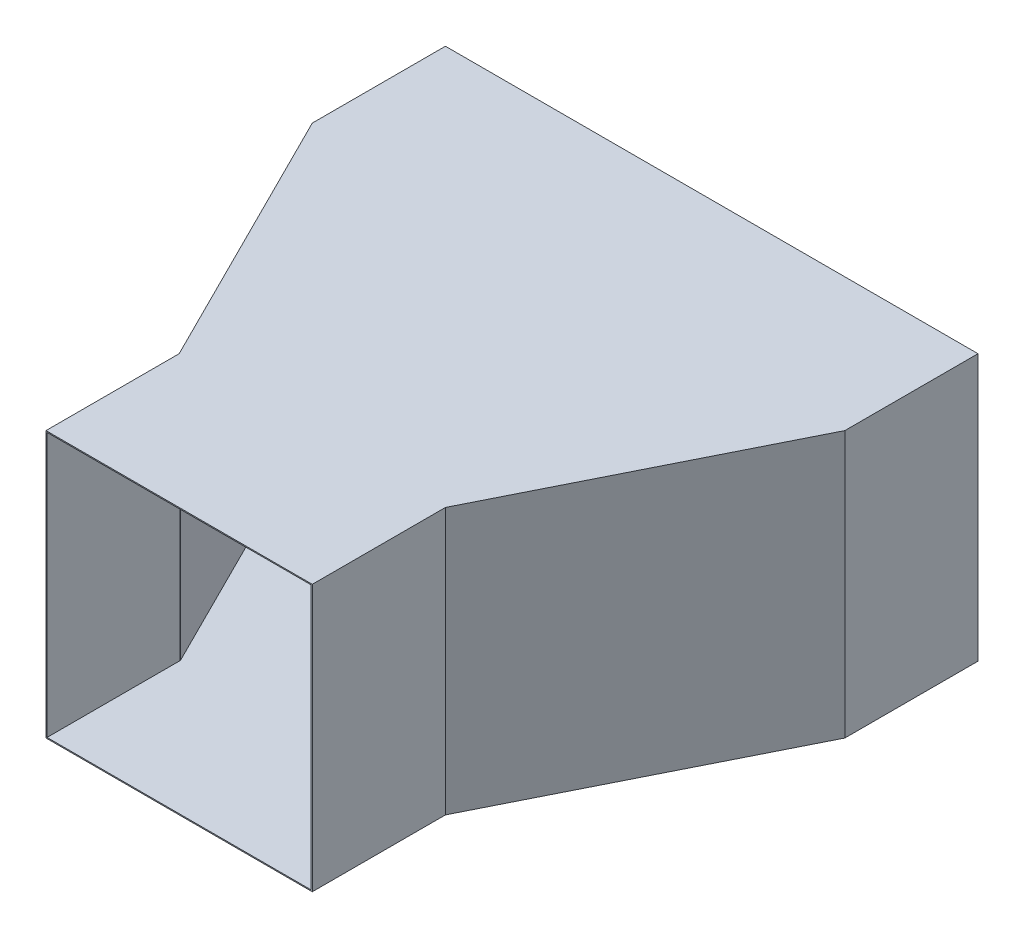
ISO-10303-21;
HEADER;
FILE_DESCRIPTION(('STEP AP214'),'2;1');
FILE_NAME('part.step','',(''),(''),'','','');
FILE_SCHEMA(('AUTOMOTIVE_DESIGN { 1 0 10303 214 1 1 1 1 }'));
ENDSEC;
DATA;
#1=APPLICATION_CONTEXT('core data for automotive mechanical design processes');
#2=APPLICATION_PROTOCOL_DEFINITION('international standard','automotive_design',2000,#1);
#3=PRODUCT_CONTEXT('',#1,'mechanical');
#4=PRODUCT('Part','Part','',(#3));
#5=PRODUCT_RELATED_PRODUCT_CATEGORY('part','',(#4));
#6=PRODUCT_DEFINITION_FORMATION('','',#4);
#7=PRODUCT_DEFINITION_CONTEXT('part definition',#1,'design');
#8=PRODUCT_DEFINITION('design','',#6,#7);
#9=PRODUCT_DEFINITION_SHAPE('','',#8);
#10=(LENGTH_UNIT() NAMED_UNIT(*) SI_UNIT(.MILLI.,.METRE.));
#11=(NAMED_UNIT(*) PLANE_ANGLE_UNIT() SI_UNIT($,.RADIAN.));
#12=(NAMED_UNIT(*) SI_UNIT($,.STERADIAN.) SOLID_ANGLE_UNIT());
#13=UNCERTAINTY_MEASURE_WITH_UNIT(LENGTH_MEASURE(1.E-05),#10,'distance_accuracy_value','');
#14=(GEOMETRIC_REPRESENTATION_CONTEXT(3) GLOBAL_UNCERTAINTY_ASSIGNED_CONTEXT((#13)) GLOBAL_UNIT_ASSIGNED_CONTEXT((#10,
#11,#12)) REPRESENTATION_CONTEXT('',''));
#15=CARTESIAN_POINT('',(0.,0.,0.));
#16=DIRECTION('',(0.,0.,1.));
#17=DIRECTION('',(1.,0.,0.));
#18=AXIS2_PLACEMENT_3D('',#15,#16,#17);
#19=CARTESIAN_POINT('',(0.,0.,500.));
#20=DIRECTION('',(0.,0.,1.));
#21=DIRECTION('',(1.,0.,0.));
#22=AXIS2_PLACEMENT_3D('',#19,#20,#21);
#23=PLANE('',#22);
#24=DIRECTION('',(0.,-1.,0.));
#25=VECTOR('',#24,1.);
#26=CARTESIAN_POINT('',(-247.7639320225,0.,500.));
#27=LINE('',#26,#25);
#28=CARTESIAN_POINT('',(-247.7639320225,248.,500.));
#29=VERTEX_POINT('',#28);
#30=CARTESIAN_POINT('',(-247.7639320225,-248.,500.));
#31=VERTEX_POINT('',#30);
#32=EDGE_CURVE('E367',#29,#31,#27,.T.);
#33=ORIENTED_EDGE('',*,*,#32,.F.);
#34=DIRECTION('',(-1.,0.,0.));
#35=VECTOR('',#34,1.);
#36=CARTESIAN_POINT('',(-250.,248.,500.));
#37=LINE('',#36,#35);
#38=CARTESIAN_POINT('',(-248.,248.,500.));
#39=VERTEX_POINT('',#38);
#40=EDGE_CURVE('E12',#29,#39,#37,.T.);
#41=ORIENTED_EDGE('',*,*,#40,.T.);
#42=DIRECTION('',(0.,-1.,0.));
#43=VECTOR('',#42,1.);
#44=CARTESIAN_POINT('',(-248.,250.,500.));
#45=LINE('',#44,#43);
#46=CARTESIAN_POINT('',(-248.,-248.,500.));
#47=VERTEX_POINT('',#46);
#48=EDGE_CURVE('E263',#39,#47,#45,.T.);
#49=ORIENTED_EDGE('',*,*,#48,.T.);
#50=DIRECTION('',(1.,0.,0.));
#51=VECTOR('',#50,1.);
#52=CARTESIAN_POINT('',(-250.,-248.,500.));
#53=LINE('',#52,#51);
#54=EDGE_CURVE('E241',#47,#31,#53,.T.);
#55=ORIENTED_EDGE('',*,*,#54,.T.);
#56=EDGE_LOOP('',(#33,#41,#49,#55));
#57=FACE_BOUND('',#56,.T.);
#58=ADVANCED_FACE('F90',(#57),#23,.T.);
#59=DIRECTION('',(0.,1.,0.));
#60=VECTOR('',#59,1.);
#61=CARTESIAN_POINT('',(248.,250.,500.));
#62=LINE('',#61,#60);
#63=CARTESIAN_POINT('',(248.,-248.,500.));
#64=VERTEX_POINT('',#63);
#65=CARTESIAN_POINT('',(248.,248.,500.));
#66=VERTEX_POINT('',#65);
#67=EDGE_CURVE('E261',#64,#66,#62,.T.);
#68=ORIENTED_EDGE('',*,*,#67,.T.);
#69=CARTESIAN_POINT('',(247.7639320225,248.,500.));
#70=VERTEX_POINT('',#69);
#71=EDGE_CURVE('E248',#66,#70,#37,.T.);
#72=ORIENTED_EDGE('',*,*,#71,.T.);
#73=DIRECTION('',(0.,1.,0.));
#74=VECTOR('',#73,1.);
#75=CARTESIAN_POINT('',(247.7639320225,0.,500.));
#76=LINE('',#75,#74);
#77=CARTESIAN_POINT('',(247.7639320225,-248.,500.));
#78=VERTEX_POINT('',#77);
#79=EDGE_CURVE('E373',#78,#70,#76,.T.);
#80=ORIENTED_EDGE('',*,*,#79,.F.);
#81=EDGE_CURVE('E101',#78,#64,#53,.T.);
#82=ORIENTED_EDGE('',*,*,#81,.T.);
#83=EDGE_LOOP('',(#68,#72,#80,#82));
#84=FACE_BOUND('',#83,.T.);
#85=ADVANCED_FACE('F520',(#84),#23,.T.);
#86=CARTESIAN_POINT('',(500.,250.,-250.));
#87=DIRECTION('',(1.,0.,0.));
#88=DIRECTION('',(0.,0.,-1.));
#89=AXIS2_PLACEMENT_3D('',#86,#87,#88);
#90=PLANE('',#89);
#91=CARTESIAN_POINT('',(500.,-250.,0.));
#92=DIRECTION('',(0.,1.,0.));
#93=VECTOR('',#92,1.);
#94=LINE('',#91,#93);
#95=CARTESIAN_POINT('',(500.,-250.,0.));
#96=VERTEX_POINT('',#95);
#97=CARTESIAN_POINT('',(500.,250.,0.));
#98=VERTEX_POINT('',#97);
#99=EDGE_CURVE('E462',#96,#98,#94,.T.);
#100=ORIENTED_EDGE('',*,*,#99,.F.);
#101=DIRECTION('',(0.,0.,1.));
#102=VECTOR('',#101,1.);
#103=CARTESIAN_POINT('',(500.,-250.,-250.));
#104=LINE('',#103,#102);
#105=CARTESIAN_POINT('',(500.,-250.,-250.));
#106=VERTEX_POINT('',#105);
#107=EDGE_CURVE('E491',#106,#96,#104,.T.);
#108=ORIENTED_EDGE('',*,*,#107,.F.);
#109=DIRECTION('',(0.,1.,0.));
#110=VECTOR('',#109,1.);
#111=CARTESIAN_POINT('',(500.,250.,-250.));
#112=LINE('',#111,#110);
#113=CARTESIAN_POINT('',(500.,250.,-250.));
#114=VERTEX_POINT('',#113);
#115=EDGE_CURVE('E470',#106,#114,#112,.T.);
#116=ORIENTED_EDGE('',*,*,#115,.T.);
#117=DIRECTION('',(0.,0.,1.));
#118=VECTOR('',#117,1.);
#119=CARTESIAN_POINT('',(500.,250.,-250.));
#120=LINE('',#119,#118);
#121=EDGE_CURVE('E479',#114,#98,#120,.T.);
#122=ORIENTED_EDGE('',*,*,#121,.T.);
#123=EDGE_LOOP('',(#100,#108,#116,#122));
#124=FACE_BOUND('',#123,.T.);
#125=ADVANCED_FACE('F92',(#124),#90,.T.);
#126=CARTESIAN_POINT('',(-500.,-250.,-250.));
#127=DIRECTION('',(0.,-1.,0.));
#128=DIRECTION('',(0.,0.,-1.));
#129=AXIS2_PLACEMENT_3D('',#126,#127,#128);
#130=PLANE('',#129);
#131=ORIENTED_EDGE('',*,*,#107,.T.);
#132=DIRECTION('',(0.447213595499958,0.,-0.894427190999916));
#133=VECTOR('',#132,1.);
#134=CARTESIAN_POINT('',(250.,-250.,500.));
#135=LINE('',#134,#133);
#136=CARTESIAN_POINT('',(250.,-250.,500.));
#137=VERTEX_POINT('',#136);
#138=EDGE_CURVE('E370',#137,#96,#135,.T.);
#139=ORIENTED_EDGE('',*,*,#138,.F.);
#140=DIRECTION('',(0.,0.,-1.));
#141=VECTOR('',#140,1.);
#142=CARTESIAN_POINT('',(250.,-250.,750.));
#143=LINE('',#142,#141);
#144=CARTESIAN_POINT('',(250.,-250.,750.));
#145=VERTEX_POINT('',#144);
#146=EDGE_CURVE('E278',#145,#137,#143,.T.);
#147=ORIENTED_EDGE('',*,*,#146,.F.);
#148=DIRECTION('',(1.,0.,0.));
#149=VECTOR('',#148,1.);
#150=CARTESIAN_POINT('',(-250.,-250.,750.));
#151=LINE('',#150,#149);
#152=CARTESIAN_POINT('',(-250.,-250.,750.));
#153=VERTEX_POINT('',#152);
#154=EDGE_CURVE('E276',#153,#145,#151,.T.);
#155=ORIENTED_EDGE('',*,*,#154,.F.);
#156=DIRECTION('',(0.,0.,-1.));
#157=VECTOR('',#156,1.);
#158=CARTESIAN_POINT('',(-250.,-250.,750.));
#159=LINE('',#158,#157);
#160=CARTESIAN_POINT('',(-250.,-250.,500.));
#161=VERTEX_POINT('',#160);
#162=EDGE_CURVE('E297',#153,#161,#159,.T.);
#163=ORIENTED_EDGE('',*,*,#162,.T.);
#164=DIRECTION('',(-0.447213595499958,0.,-0.894427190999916));
#165=VECTOR('',#164,1.);
#166=CARTESIAN_POINT('',(-250.,-250.,500.));
#167=LINE('',#166,#165);
#168=CARTESIAN_POINT('',(-500.,-250.,0.));
#169=VERTEX_POINT('',#168);
#170=EDGE_CURVE('E366',#161,#169,#167,.T.);
#171=ORIENTED_EDGE('',*,*,#170,.T.);
#172=DIRECTION('',(0.,0.,1.));
#173=VECTOR('',#172,1.);
#174=CARTESIAN_POINT('',(-500.,-250.,-250.));
#175=LINE('',#174,#173);
#176=CARTESIAN_POINT('',(-500.,-250.,-250.));
#177=VERTEX_POINT('',#176);
#178=EDGE_CURVE('E485',#177,#169,#175,.T.);
#179=ORIENTED_EDGE('',*,*,#178,.F.);
#180=DIRECTION('',(1.,0.,0.));
#181=VECTOR('',#180,1.);
#182=CARTESIAN_POINT('',(-500.,-250.,-250.));
#183=LINE('',#182,#181);
#184=EDGE_CURVE('E477',#177,#106,#183,.T.);
#185=ORIENTED_EDGE('',*,*,#184,.T.);
#186=EDGE_LOOP('',(#131,#139,#147,#155,#163,#171,#179,#185));
#187=FACE_BOUND('',#186,.T.);
#188=ADVANCED_FACE('F494',(#187),#130,.T.);
#189=CARTESIAN_POINT('',(-500.,250.,-250.));
#190=DIRECTION('',(-1.,0.,0.));
#191=DIRECTION('',(0.,-1.,0.));
#192=AXIS2_PLACEMENT_3D('',#189,#190,#191);
#193=PLANE('',#192);
#194=CARTESIAN_POINT('',(-500.,250.,0.));
#195=DIRECTION('',(0.,-1.,0.));
#196=VECTOR('',#195,1.);
#197=LINE('',#194,#196);
#198=CARTESIAN_POINT('',(-500.,250.,0.));
#199=VERTEX_POINT('',#198);
#200=EDGE_CURVE('E415',#199,#169,#197,.T.);
#201=ORIENTED_EDGE('',*,*,#200,.F.);
#202=DIRECTION('',(0.,0.,1.));
#203=VECTOR('',#202,1.);
#204=CARTESIAN_POINT('',(-500.,250.,-250.));
#205=LINE('',#204,#203);
#206=CARTESIAN_POINT('',(-500.,250.,-250.));
#207=VERTEX_POINT('',#206);
#208=EDGE_CURVE('E362',#207,#199,#205,.T.);
#209=ORIENTED_EDGE('',*,*,#208,.F.);
#210=DIRECTION('',(0.,-1.,0.));
#211=VECTOR('',#210,1.);
#212=CARTESIAN_POINT('',(-500.,250.,-250.));
#213=LINE('',#212,#211);
#214=EDGE_CURVE('E475',#207,#177,#213,.T.);
#215=ORIENTED_EDGE('',*,*,#214,.T.);
#216=ORIENTED_EDGE('',*,*,#178,.T.);
#217=EDGE_LOOP('',(#201,#209,#215,#216));
#218=FACE_BOUND('',#217,.T.);
#219=ADVANCED_FACE('F570',(#218),#193,.T.);
#220=CARTESIAN_POINT('',(-500.,250.,-250.));
#221=DIRECTION('',(0.,1.,0.));
#222=DIRECTION('',(0.,0.,1.));
#223=AXIS2_PLACEMENT_3D('',#220,#221,#222);
#224=PLANE('',#223);
#225=ORIENTED_EDGE('',*,*,#208,.T.);
#226=DIRECTION('',(-0.447213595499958,0.,-0.894427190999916));
#227=VECTOR('',#226,1.);
#228=CARTESIAN_POINT('',(-250.,250.,500.));
#229=LINE('',#228,#227);
#230=CARTESIAN_POINT('',(-250.,250.,500.));
#231=VERTEX_POINT('',#230);
#232=EDGE_CURVE('E360',#231,#199,#229,.T.);
#233=ORIENTED_EDGE('',*,*,#232,.F.);
#234=DIRECTION('',(0.,0.,-1.));
#235=VECTOR('',#234,1.);
#236=CARTESIAN_POINT('',(-250.,250.,750.));
#237=LINE('',#236,#235);
#238=CARTESIAN_POINT('',(-250.,250.,750.));
#239=VERTEX_POINT('',#238);
#240=EDGE_CURVE('E302',#239,#231,#237,.T.);
#241=ORIENTED_EDGE('',*,*,#240,.F.);
#242=DIRECTION('',(-1.,0.,0.));
#243=VECTOR('',#242,1.);
#244=CARTESIAN_POINT('',(-250.,250.,750.));
#245=LINE('',#244,#243);
#246=CARTESIAN_POINT('',(250.,250.,750.));
#247=VERTEX_POINT('',#246);
#248=EDGE_CURVE('E272',#247,#239,#245,.T.);
#249=ORIENTED_EDGE('',*,*,#248,.F.);
#250=DIRECTION('',(0.,0.,-1.));
#251=VECTOR('',#250,1.);
#252=CARTESIAN_POINT('',(250.,250.,750.));
#253=LINE('',#252,#251);
#254=CARTESIAN_POINT('',(250.,250.,500.));
#255=VERTEX_POINT('',#254);
#256=EDGE_CURVE('E349',#247,#255,#253,.T.);
#257=ORIENTED_EDGE('',*,*,#256,.T.);
#258=DIRECTION('',(0.447213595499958,0.,-0.894427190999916));
#259=VECTOR('',#258,1.);
#260=CARTESIAN_POINT('',(250.,250.,500.));
#261=LINE('',#260,#259);
#262=EDGE_CURVE('E497',#255,#98,#261,.T.);
#263=ORIENTED_EDGE('',*,*,#262,.T.);
#264=ORIENTED_EDGE('',*,*,#121,.F.);
#265=DIRECTION('',(-1.,0.,0.));
#266=VECTOR('',#265,1.);
#267=CARTESIAN_POINT('',(-500.,250.,-250.));
#268=LINE('',#267,#266);
#269=EDGE_CURVE('E473',#114,#207,#268,.T.);
#270=ORIENTED_EDGE('',*,*,#269,.T.);
#271=EDGE_LOOP('',(#225,#233,#241,#249,#257,#263,#264,#270));
#272=FACE_BOUND('',#271,.T.);
#273=ADVANCED_FACE('F358',(#272),#224,.T.);
#274=CARTESIAN_POINT('',(0.,0.,-250.));
#275=DIRECTION('',(0.,0.,1.));
#276=DIRECTION('',(1.,0.,0.));
#277=AXIS2_PLACEMENT_3D('',#274,#275,#276);
#278=PLANE('',#277);
#279=DIRECTION('',(1.,0.,0.));
#280=VECTOR('',#279,1.);
#281=CARTESIAN_POINT('',(-500.,-248.,-250.));
#282=LINE('',#281,#280);
#283=CARTESIAN_POINT('',(-498.,-248.,-250.));
#284=VERTEX_POINT('',#283);
#285=CARTESIAN_POINT('',(498.,-248.,-250.));
#286=VERTEX_POINT('',#285);
#287=EDGE_CURVE('E434',#284,#286,#282,.T.);
#288=ORIENTED_EDGE('',*,*,#287,.T.);
#289=DIRECTION('',(0.,1.,0.));
#290=VECTOR('',#289,1.);
#291=CARTESIAN_POINT('',(498.,250.,-250.));
#292=LINE('',#291,#290);
#293=CARTESIAN_POINT('',(498.,248.,-250.));
#294=VERTEX_POINT('',#293);
#295=EDGE_CURVE('E426',#286,#294,#292,.T.);
#296=ORIENTED_EDGE('',*,*,#295,.T.);
#297=DIRECTION('',(-1.,0.,0.));
#298=VECTOR('',#297,1.);
#299=CARTESIAN_POINT('',(-500.,248.,-250.));
#300=LINE('',#299,#298);
#301=CARTESIAN_POINT('',(-498.,248.,-250.));
#302=VERTEX_POINT('',#301);
#303=EDGE_CURVE('E429',#294,#302,#300,.T.);
#304=ORIENTED_EDGE('',*,*,#303,.T.);
#305=DIRECTION('',(0.,-1.,0.));
#306=VECTOR('',#305,1.);
#307=CARTESIAN_POINT('',(-498.,250.,-250.));
#308=LINE('',#307,#306);
#309=EDGE_CURVE('E117',#302,#284,#308,.T.);
#310=ORIENTED_EDGE('',*,*,#309,.T.);
#311=EDGE_LOOP('',(#288,#296,#304,#310));
#312=FACE_BOUND('',#311,.T.);
#313=ORIENTED_EDGE('',*,*,#115,.F.);
#314=ORIENTED_EDGE('',*,*,#184,.F.);
#315=ORIENTED_EDGE('',*,*,#214,.F.);
#316=ORIENTED_EDGE('',*,*,#269,.F.);
#317=EDGE_LOOP('',(#313,#314,#315,#316));
#318=FACE_BOUND('',#317,.T.);
#319=ADVANCED_FACE('F581',(#312,#318),#278,.F.);
#320=CARTESIAN_POINT('',(498.,250.,-250.));
#321=DIRECTION('',(1.,0.,0.));
#322=DIRECTION('',(0.,0.,-1.));
#323=AXIS2_PLACEMENT_3D('',#320,#321,#322);
#324=PLANE('',#323);
#325=DIRECTION('',(0.,1.,0.));
#326=VECTOR('',#325,1.);
#327=CARTESIAN_POINT('',(498.,250.,0.));
#328=LINE('',#327,#326);
#329=CARTESIAN_POINT('',(498.,-248.,0.));
#330=VERTEX_POINT('',#329);
#331=CARTESIAN_POINT('',(498.,248.,0.));
#332=VERTEX_POINT('',#331);
#333=EDGE_CURVE('E438',#330,#332,#328,.T.);
#334=ORIENTED_EDGE('',*,*,#333,.T.);
#335=DIRECTION('',(0.,0.,1.));
#336=VECTOR('',#335,1.);
#337=CARTESIAN_POINT('',(498.,248.,-250.));
#338=LINE('',#337,#336);
#339=EDGE_CURVE('E437',#294,#332,#338,.T.);
#340=ORIENTED_EDGE('',*,*,#339,.F.);
#341=ORIENTED_EDGE('',*,*,#295,.F.);
#342=DIRECTION('',(0.,0.,1.));
#343=VECTOR('',#342,1.);
#344=CARTESIAN_POINT('',(498.,-248.,-250.));
#345=LINE('',#344,#343);
#346=EDGE_CURVE('E458',#286,#330,#345,.T.);
#347=ORIENTED_EDGE('',*,*,#346,.T.);
#348=EDGE_LOOP('',(#334,#340,#341,#347));
#349=FACE_BOUND('',#348,.T.);
#350=ADVANCED_FACE('F585',(#349),#324,.F.);
#351=CARTESIAN_POINT('',(-500.,-248.,-250.));
#352=DIRECTION('',(0.,-1.,0.));
#353=DIRECTION('',(0.,0.,-1.));
#354=AXIS2_PLACEMENT_3D('',#351,#352,#353);
#355=PLANE('',#354);
#356=DIRECTION('',(1.,0.,0.));
#357=VECTOR('',#356,1.);
#358=CARTESIAN_POINT('',(-500.,-248.,0.));
#359=LINE('',#358,#357);
#360=CARTESIAN_POINT('',(-498.,-248.,0.));
#361=VERTEX_POINT('',#360);
#362=CARTESIAN_POINT('',(-497.7639320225,-248.,0.));
#363=VERTEX_POINT('',#362);
#364=EDGE_CURVE('E430',#361,#363,#359,.T.);
#365=ORIENTED_EDGE('',*,*,#364,.T.);
#366=DIRECTION('',(-0.447213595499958,0.,-0.894427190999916));
#367=VECTOR('',#366,1.);
#368=CARTESIAN_POINT('',(-398.211145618,-248.,199.105572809));
#369=LINE('',#368,#367);
#370=EDGE_CURVE('E532',#31,#363,#369,.T.);
#371=ORIENTED_EDGE('',*,*,#370,.F.);
#372=ORIENTED_EDGE('',*,*,#54,.F.);
#373=DIRECTION('',(0.,0.,-1.));
#374=VECTOR('',#373,1.);
#375=CARTESIAN_POINT('',(-248.,-248.,750.));
#376=LINE('',#375,#374);
#377=CARTESIAN_POINT('',(-248.,-248.,750.));
#378=VERTEX_POINT('',#377);
#379=EDGE_CURVE('E267',#378,#47,#376,.T.);
#380=ORIENTED_EDGE('',*,*,#379,.F.);
#381=DIRECTION('',(1.,0.,0.));
#382=VECTOR('',#381,1.);
#383=CARTESIAN_POINT('',(-250.,-248.,750.));
#384=LINE('',#383,#382);
#385=CARTESIAN_POINT('',(248.,-248.,750.));
#386=VERTEX_POINT('',#385);
#387=EDGE_CURVE('E257',#378,#386,#384,.T.);
#388=ORIENTED_EDGE('',*,*,#387,.T.);
#389=DIRECTION('',(0.,0.,-1.));
#390=VECTOR('',#389,1.);
#391=CARTESIAN_POINT('',(248.,-248.,750.));
#392=LINE('',#391,#390);
#393=EDGE_CURVE('E109',#386,#64,#392,.T.);
#394=ORIENTED_EDGE('',*,*,#393,.T.);
#395=ORIENTED_EDGE('',*,*,#81,.F.);
#396=DIRECTION('',(0.447213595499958,0.,-0.894427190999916));
#397=VECTOR('',#396,1.);
#398=CARTESIAN_POINT('',(398.211145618,-248.,199.105572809));
#399=LINE('',#398,#397);
#400=CARTESIAN_POINT('',(497.7639320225,-248.,0.));
#401=VERTEX_POINT('',#400);
#402=EDGE_CURVE('E539',#78,#401,#399,.T.);
#403=ORIENTED_EDGE('',*,*,#402,.T.);
#404=EDGE_CURVE('E452',#401,#330,#359,.T.);
#405=ORIENTED_EDGE('',*,*,#404,.T.);
#406=ORIENTED_EDGE('',*,*,#346,.F.);
#407=ORIENTED_EDGE('',*,*,#287,.F.);
#408=DIRECTION('',(0.,0.,1.));
#409=VECTOR('',#408,1.);
#410=CARTESIAN_POINT('',(-498.,-248.,-250.));
#411=LINE('',#410,#409);
#412=EDGE_CURVE('E463',#284,#361,#411,.T.);
#413=ORIENTED_EDGE('',*,*,#412,.T.);
#414=EDGE_LOOP('',(#365,#371,#372,#380,#388,#394,#395,#403,#405,#406,#407,#413));
#415=FACE_BOUND('',#414,.T.);
#416=ADVANCED_FACE('F590',(#415),#355,.F.);
#417=CARTESIAN_POINT('',(-498.,250.,-250.));
#418=DIRECTION('',(-1.,0.,0.));
#419=DIRECTION('',(0.,-1.,0.));
#420=AXIS2_PLACEMENT_3D('',#417,#418,#419);
#421=PLANE('',#420);
#422=DIRECTION('',(0.,-1.,0.));
#423=VECTOR('',#422,1.);
#424=CARTESIAN_POINT('',(-498.,250.,0.));
#425=LINE('',#424,#423);
#426=CARTESIAN_POINT('',(-498.,248.,0.));
#427=VERTEX_POINT('',#426);
#428=EDGE_CURVE('E444',#427,#361,#425,.T.);
#429=ORIENTED_EDGE('',*,*,#428,.T.);
#430=ORIENTED_EDGE('',*,*,#412,.F.);
#431=ORIENTED_EDGE('',*,*,#309,.F.);
#432=DIRECTION('',(0.,0.,1.));
#433=VECTOR('',#432,1.);
#434=CARTESIAN_POINT('',(-498.,248.,-250.));
#435=LINE('',#434,#433);
#436=EDGE_CURVE('E466',#302,#427,#435,.T.);
#437=ORIENTED_EDGE('',*,*,#436,.T.);
#438=EDGE_LOOP('',(#429,#430,#431,#437));
#439=FACE_BOUND('',#438,.T.);
#440=ADVANCED_FACE('F598',(#439),#421,.F.);
#441=CARTESIAN_POINT('',(-500.,248.,-250.));
#442=DIRECTION('',(0.,1.,0.));
#443=DIRECTION('',(0.,0.,1.));
#444=AXIS2_PLACEMENT_3D('',#441,#442,#443);
#445=PLANE('',#444);
#446=DIRECTION('',(-1.,0.,0.));
#447=VECTOR('',#446,1.);
#448=CARTESIAN_POINT('',(-500.,248.,0.));
#449=LINE('',#448,#447);
#450=CARTESIAN_POINT('',(497.7639320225,248.,0.));
#451=VERTEX_POINT('',#450);
#452=EDGE_CURVE('E450',#332,#451,#449,.T.);
#453=ORIENTED_EDGE('',*,*,#452,.T.);
#454=DIRECTION('',(0.447213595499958,0.,-0.894427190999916));
#455=VECTOR('',#454,1.);
#456=CARTESIAN_POINT('',(398.211145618,248.,199.105572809));
#457=LINE('',#456,#455);
#458=EDGE_CURVE('E546',#70,#451,#457,.T.);
#459=ORIENTED_EDGE('',*,*,#458,.F.);
#460=ORIENTED_EDGE('',*,*,#71,.F.);
#461=DIRECTION('',(0.,0.,-1.));
#462=VECTOR('',#461,1.);
#463=CARTESIAN_POINT('',(248.,248.,750.));
#464=LINE('',#463,#462);
#465=CARTESIAN_POINT('',(248.,248.,750.));
#466=VERTEX_POINT('',#465);
#467=EDGE_CURVE('E235',#466,#66,#464,.T.);
#468=ORIENTED_EDGE('',*,*,#467,.F.);
#469=DIRECTION('',(-1.,0.,0.));
#470=VECTOR('',#469,1.);
#471=CARTESIAN_POINT('',(-250.,248.,750.));
#472=LINE('',#471,#470);
#473=CARTESIAN_POINT('',(-248.,248.,750.));
#474=VERTEX_POINT('',#473);
#475=EDGE_CURVE('E240',#466,#474,#472,.T.);
#476=ORIENTED_EDGE('',*,*,#475,.T.);
#477=DIRECTION('',(0.,0.,-1.));
#478=VECTOR('',#477,1.);
#479=CARTESIAN_POINT('',(-248.,248.,750.));
#480=LINE('',#479,#478);
#481=EDGE_CURVE('E250',#474,#39,#480,.T.);
#482=ORIENTED_EDGE('',*,*,#481,.T.);
#483=ORIENTED_EDGE('',*,*,#40,.F.);
#484=DIRECTION('',(-0.447213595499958,0.,-0.894427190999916));
#485=VECTOR('',#484,1.);
#486=CARTESIAN_POINT('',(-398.211145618,248.,199.105572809));
#487=LINE('',#486,#485);
#488=CARTESIAN_POINT('',(-497.7639320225,248.,0.));
#489=VERTEX_POINT('',#488);
#490=EDGE_CURVE('E535',#29,#489,#487,.T.);
#491=ORIENTED_EDGE('',*,*,#490,.T.);
#492=EDGE_CURVE('E441',#489,#427,#449,.T.);
#493=ORIENTED_EDGE('',*,*,#492,.T.);
#494=ORIENTED_EDGE('',*,*,#436,.F.);
#495=ORIENTED_EDGE('',*,*,#303,.F.);
#496=ORIENTED_EDGE('',*,*,#339,.T.);
#497=EDGE_LOOP('',(#453,#459,#460,#468,#476,#482,#483,#491,#493,#494,#495,#496));
#498=FACE_BOUND('',#497,.T.);
#499=ADVANCED_FACE('F245',(#498),#445,.F.);
#500=CARTESIAN_POINT('',(0.,0.,0.));
#501=DIRECTION('',(0.,0.,1.));
#502=DIRECTION('',(1.,0.,0.));
#503=AXIS2_PLACEMENT_3D('',#500,#501,#502);
#504=PLANE('',#503);
#505=ORIENTED_EDGE('',*,*,#404,.F.);
#506=DIRECTION('',(0.,1.,0.));
#507=VECTOR('',#506,1.);
#508=CARTESIAN_POINT('',(497.7639320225,0.,0.));
#509=LINE('',#508,#507);
#510=EDGE_CURVE('E352',#401,#451,#509,.T.);
#511=ORIENTED_EDGE('',*,*,#510,.T.);
#512=ORIENTED_EDGE('',*,*,#452,.F.);
#513=ORIENTED_EDGE('',*,*,#333,.F.);
#514=EDGE_LOOP('',(#505,#511,#512,#513));
#515=FACE_BOUND('',#514,.T.);
#516=ADVANCED_FACE('F597',(#515),#504,.F.);
#517=ORIENTED_EDGE('',*,*,#364,.F.);
#518=ORIENTED_EDGE('',*,*,#428,.F.);
#519=ORIENTED_EDGE('',*,*,#492,.F.);
#520=DIRECTION('',(0.,-1.,0.));
#521=VECTOR('',#520,1.);
#522=CARTESIAN_POINT('',(-497.7639320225,-1.10525795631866E-13,0.));
#523=LINE('',#522,#521);
#524=EDGE_CURVE('E536',#489,#363,#523,.T.);
#525=ORIENTED_EDGE('',*,*,#524,.T.);
#526=EDGE_LOOP('',(#517,#518,#519,#525));
#527=FACE_BOUND('',#526,.T.);
#528=ADVANCED_FACE('F398',(#527),#504,.F.);
#529=CARTESIAN_POINT('',(400.,0.,200.));
#530=DIRECTION('',(0.894427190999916,0.,0.447213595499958));
#531=DIRECTION('',(0.447213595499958,0.,-0.894427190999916));
#532=AXIS2_PLACEMENT_3D('',#529,#530,#531);
#533=PLANE('',#532);
#534=ORIENTED_EDGE('',*,*,#138,.T.);
#535=ORIENTED_EDGE('',*,*,#99,.T.);
#536=ORIENTED_EDGE('',*,*,#262,.F.);
#537=DIRECTION('',(0.,1.,0.));
#538=VECTOR('',#537,1.);
#539=CARTESIAN_POINT('',(250.,250.,500.));
#540=LINE('',#539,#538);
#541=EDGE_CURVE('E95',#137,#255,#540,.T.);
#542=ORIENTED_EDGE('',*,*,#541,.F.);
#543=EDGE_LOOP('',(#534,#535,#536,#542));
#544=FACE_BOUND('',#543,.T.);
#545=ADVANCED_FACE('F387',(#544),#533,.T.);
#546=CARTESIAN_POINT('',(-400.,0.,200.));
#547=DIRECTION('',(-0.894427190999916,0.,0.447213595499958));
#548=DIRECTION('',(0.447213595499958,0.,0.894427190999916));
#549=AXIS2_PLACEMENT_3D('',#546,#547,#548);
#550=PLANE('',#549);
#551=ORIENTED_EDGE('',*,*,#232,.T.);
#552=ORIENTED_EDGE('',*,*,#200,.T.);
#553=ORIENTED_EDGE('',*,*,#170,.F.);
#554=DIRECTION('',(0.,-1.,0.));
#555=VECTOR('',#554,1.);
#556=CARTESIAN_POINT('',(-250.,250.,500.));
#557=LINE('',#556,#555);
#558=EDGE_CURVE('E310',#231,#161,#557,.T.);
#559=ORIENTED_EDGE('',*,*,#558,.F.);
#560=EDGE_LOOP('',(#551,#552,#553,#559));
#561=FACE_BOUND('',#560,.T.);
#562=ADVANCED_FACE('F397',(#561),#550,.T.);
#563=CARTESIAN_POINT('',(398.211145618,0.,199.105572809));
#564=DIRECTION('',(0.894427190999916,0.,0.447213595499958));
#565=DIRECTION('',(0.447213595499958,0.,-0.894427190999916));
#566=AXIS2_PLACEMENT_3D('',#563,#564,#565);
#567=PLANE('',#566);
#568=ORIENTED_EDGE('',*,*,#402,.F.);
#569=ORIENTED_EDGE('',*,*,#79,.T.);
#570=ORIENTED_EDGE('',*,*,#458,.T.);
#571=ORIENTED_EDGE('',*,*,#510,.F.);
#572=EDGE_LOOP('',(#568,#569,#570,#571));
#573=FACE_BOUND('',#572,.T.);
#574=ADVANCED_FACE('F333',(#573),#567,.F.);
#575=CARTESIAN_POINT('',(-398.211145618,0.,199.105572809));
#576=DIRECTION('',(-0.894427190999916,0.,0.447213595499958));
#577=DIRECTION('',(0.447213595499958,0.,0.894427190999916));
#578=AXIS2_PLACEMENT_3D('',#575,#576,#577);
#579=PLANE('',#578);
#580=ORIENTED_EDGE('',*,*,#490,.F.);
#581=ORIENTED_EDGE('',*,*,#32,.T.);
#582=ORIENTED_EDGE('',*,*,#370,.T.);
#583=ORIENTED_EDGE('',*,*,#524,.F.);
#584=EDGE_LOOP('',(#580,#581,#582,#583));
#585=FACE_BOUND('',#584,.T.);
#586=ADVANCED_FACE('F517',(#585),#579,.F.);
#587=CARTESIAN_POINT('',(0.,0.,750.));
#588=DIRECTION('',(0.,0.,1.));
#589=DIRECTION('',(1.,0.,0.));
#590=AXIS2_PLACEMENT_3D('',#587,#588,#589);
#591=PLANE('',#590);
#592=DIRECTION('',(0.,1.,0.));
#593=VECTOR('',#592,1.);
#594=CARTESIAN_POINT('',(250.,250.,750.));
#595=LINE('',#594,#593);
#596=EDGE_CURVE('E249',#145,#247,#595,.T.);
#597=ORIENTED_EDGE('',*,*,#596,.T.);
#598=ORIENTED_EDGE('',*,*,#248,.T.);
#599=DIRECTION('',(0.,-1.,0.));
#600=VECTOR('',#599,1.);
#601=CARTESIAN_POINT('',(-250.,250.,750.));
#602=LINE('',#601,#600);
#603=EDGE_CURVE('E274',#239,#153,#602,.T.);
#604=ORIENTED_EDGE('',*,*,#603,.T.);
#605=ORIENTED_EDGE('',*,*,#154,.T.);
#606=EDGE_LOOP('',(#597,#598,#604,#605));
#607=FACE_BOUND('',#606,.T.);
#608=ORIENTED_EDGE('',*,*,#475,.F.);
#609=DIRECTION('',(0.,1.,0.));
#610=VECTOR('',#609,1.);
#611=CARTESIAN_POINT('',(248.,250.,750.));
#612=LINE('',#611,#610);
#613=EDGE_CURVE('E232',#386,#466,#612,.T.);
#614=ORIENTED_EDGE('',*,*,#613,.F.);
#615=ORIENTED_EDGE('',*,*,#387,.F.);
#616=DIRECTION('',(0.,-1.,0.));
#617=VECTOR('',#616,1.);
#618=CARTESIAN_POINT('',(-248.,250.,750.));
#619=LINE('',#618,#617);
#620=EDGE_CURVE('E255',#474,#378,#619,.T.);
#621=ORIENTED_EDGE('',*,*,#620,.F.);
#622=EDGE_LOOP('',(#608,#614,#615,#621));
#623=FACE_BOUND('',#622,.T.);
#624=ADVANCED_FACE('F253',(#607,#623),#591,.T.);
#625=CARTESIAN_POINT('',(250.,250.,750.));
#626=DIRECTION('',(-1.,0.,0.));
#627=DIRECTION('',(0.,-1.,0.));
#628=AXIS2_PLACEMENT_3D('',#625,#626,#627);
#629=PLANE('',#628);
#630=ORIENTED_EDGE('',*,*,#541,.T.);
#631=ORIENTED_EDGE('',*,*,#256,.F.);
#632=ORIENTED_EDGE('',*,*,#596,.F.);
#633=ORIENTED_EDGE('',*,*,#146,.T.);
#634=EDGE_LOOP('',(#630,#631,#632,#633));
#635=FACE_BOUND('',#634,.T.);
#636=ADVANCED_FACE('F327',(#635),#629,.F.);
#637=CARTESIAN_POINT('',(-250.,250.,750.));
#638=DIRECTION('',(1.,0.,0.));
#639=DIRECTION('',(0.,1.,0.));
#640=AXIS2_PLACEMENT_3D('',#637,#638,#639);
#641=PLANE('',#640);
#642=ORIENTED_EDGE('',*,*,#558,.T.);
#643=ORIENTED_EDGE('',*,*,#162,.F.);
#644=ORIENTED_EDGE('',*,*,#603,.F.);
#645=ORIENTED_EDGE('',*,*,#240,.T.);
#646=EDGE_LOOP('',(#642,#643,#644,#645));
#647=FACE_BOUND('',#646,.T.);
#648=ADVANCED_FACE('F317',(#647),#641,.F.);
#649=CARTESIAN_POINT('',(248.,250.,750.));
#650=DIRECTION('',(-1.,0.,0.));
#651=DIRECTION('',(0.,-1.,0.));
#652=AXIS2_PLACEMENT_3D('',#649,#650,#651);
#653=PLANE('',#652);
#654=ORIENTED_EDGE('',*,*,#67,.F.);
#655=ORIENTED_EDGE('',*,*,#393,.F.);
#656=ORIENTED_EDGE('',*,*,#613,.T.);
#657=ORIENTED_EDGE('',*,*,#467,.T.);
#658=EDGE_LOOP('',(#654,#655,#656,#657));
#659=FACE_BOUND('',#658,.T.);
#660=ADVANCED_FACE('F234',(#659),#653,.T.);
#661=CARTESIAN_POINT('',(-248.,250.,750.));
#662=DIRECTION('',(1.,0.,0.));
#663=DIRECTION('',(0.,1.,0.));
#664=AXIS2_PLACEMENT_3D('',#661,#662,#663);
#665=PLANE('',#664);
#666=ORIENTED_EDGE('',*,*,#48,.F.);
#667=ORIENTED_EDGE('',*,*,#481,.F.);
#668=ORIENTED_EDGE('',*,*,#620,.T.);
#669=ORIENTED_EDGE('',*,*,#379,.T.);
#670=EDGE_LOOP('',(#666,#667,#668,#669));
#671=FACE_BOUND('',#670,.T.);
#672=ADVANCED_FACE('F623',(#671),#665,.T.);
#673=CLOSED_SHELL('',(#58,#85,#125,#188,#219,#273,#319,#350,#416,#440,#499,#516,#528,#545,#562,
#574,#586,#624,#636,#648,#660,#672));
#674=MANIFOLD_SOLID_BREP('B2',#673);
#675=ADVANCED_BREP_SHAPE_REPRESENTATION('',(#18,#674),#14);
#676=SHAPE_DEFINITION_REPRESENTATION(#9,#675);
ENDSEC;
END-ISO-10303-21;
